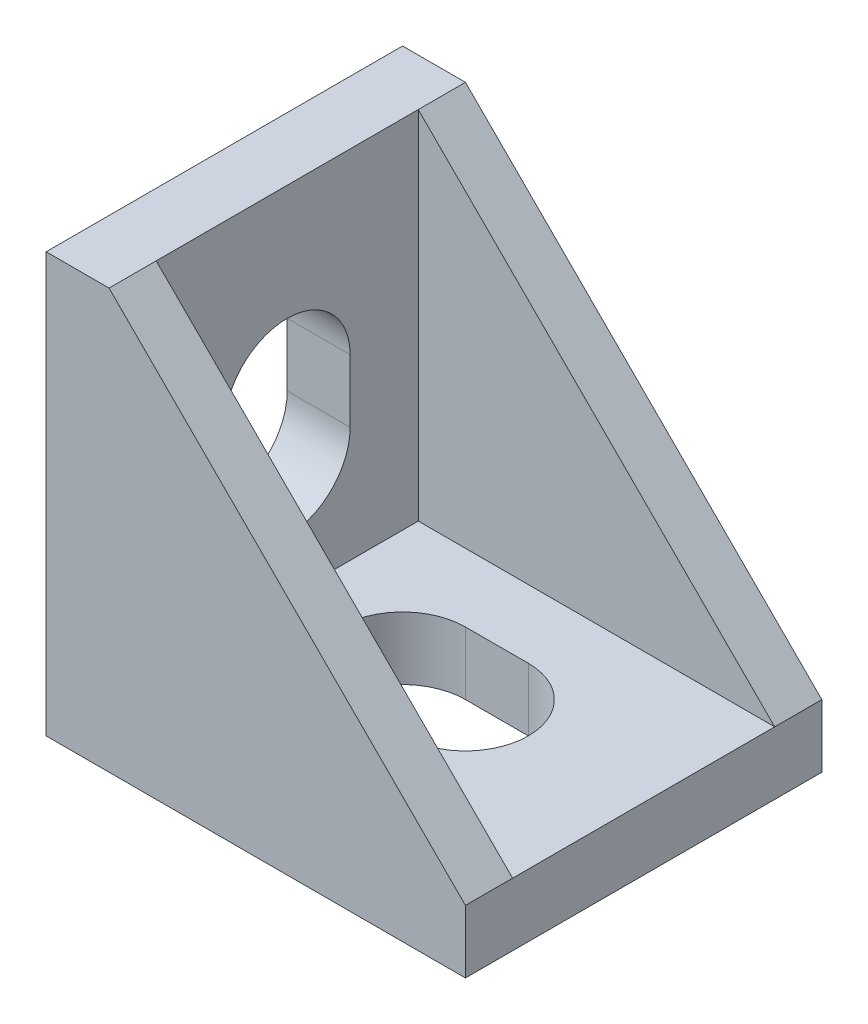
from build123d import *

# Parameters (mm, degrees)
SKETCH_1_W          = 20
SKETCH_1_H          = 20
EXTRUDE_1_DEPTH     = 8.5
CUT_EXTRUDE_1_DEPTH = 23.113344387
SKETCH_3_W          = 17
SKETCH_3_H          = 12.5
CUT_EXTRUDE_2_DEPTH = 17
CUT_EXTRUDE_3_DEPTH = 17
SKETCH_5_W          = 3.6
SKETCH_5_H          = 1.5
EXTRUDE_2_DEPTH     = 1


with BuildPart() as part:
    # Sketch 1 → Extrude 1 (new, symmetric)
    with BuildSketch(Plane.XY):
        Rectangle(SKETCH_1_W, SKETCH_1_H)
    extrude(amount=EXTRUDE_1_DEPTH, both=True)

    # Sketch 2 → Cut-Extrude 1 (cut, through all)
    with BuildSketch(Plane(origin=(0, 0, -8.5), x_dir=(-1, 0, 0), z_dir=(0, 0, -1))):
        Polygon((7, 10), (-10, 10), (-10, -7), align=None)
    extrude(amount=-CUT_EXTRUDE_1_DEPTH, mode=Mode.SUBTRACT)

    # Sketch 3 → Cut-Extrude 2 (cut)
    with BuildSketch(Plane(origin=(0, 10, 0), x_dir=(1, 0, 0), z_dir=(0, 1, 0))):
        with Locations((1.5, 0)):
            Rectangle(SKETCH_3_W, SKETCH_3_H)
    extrude(amount=-CUT_EXTRUDE_2_DEPTH, mode=Mode.SUBTRACT)

    # Sketch 4 → Cut-Extrude 3 (cut)
    with BuildSketch(Plane.ZY.offset(10)):
        with BuildLine():
            Line((3, 1.5), (3, -1.5))
            ThreePointArc((3, -1.5), (0, -4.5), (-3, -1.5))
            Line((-3, -1.5), (-3, 1.5))
            ThreePointArc((-3, 1.5), (0, 4.5), (3, 1.5))
        make_face()
    cut_extrude_3 = extrude(amount=-CUT_EXTRUDE_3_DEPTH, mode=Mode.SUBTRACT)

    # Sketch 5 → Extrude 2 (add)
    with BuildSketch(Plane.ZY.offset(10)):
        with Locations((0, 8.25)):
            Rectangle(SKETCH_5_W, SKETCH_5_H)
        with Locations((0, -7.75)):
            Rectangle(SKETCH_5_W, SKETCH_5_H)
    extrude_2 = extrude(amount=EXTRUDE_2_DEPTH)

    # Mirror 1: Cut-Extrude 3, Extrude 2 across plane
    add(cut_extrude_3.mirror(Plane(origin=(0, 0, 0), x_dir=(0, 0, 1), z_dir=(0.7071067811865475, -0.7071067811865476, 0))), mode=Mode.SUBTRACT)
    add(extrude_2.mirror(Plane(origin=(0, 0, 0), x_dir=(0, 0, 1), z_dir=(0.7071067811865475, -0.7071067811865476, 0))))


solid = part.part
